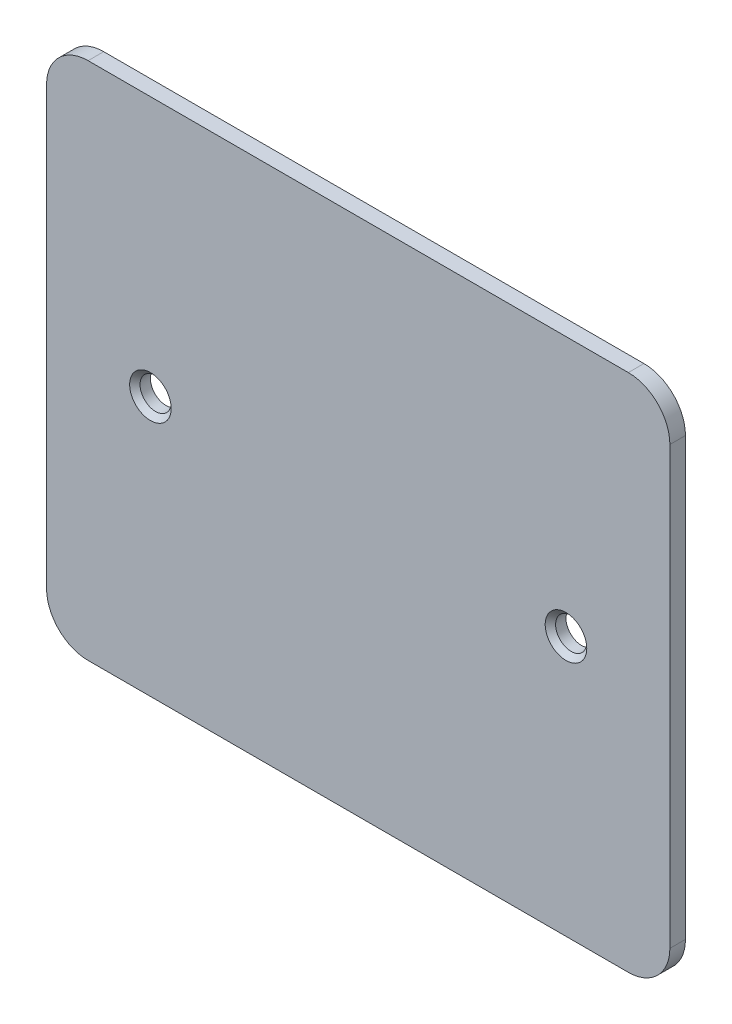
from build123d import *

# Parameters (mm, degrees)
ESQUISSE1_W      = 60
ESQUISSE1_H      = 50
ESQUISSE1_R      = 1.5
EXTRUSION1_DEPTH = 1.5
CHANFREIN1_SIZE  = 0.5
CONG_1_R         = 4


with BuildPart() as part:
    # Esquisse1 → Extrusion1 (new body)
    with BuildSketch(Plane.XY):
        with Locations((-30, 25)):
            Rectangle(ESQUISSE1_W, ESQUISSE1_H)
        with Locations((-50, 25)):
            Circle(ESQUISSE1_R, mode=Mode.SUBTRACT)
        with Locations((-10, 25)):
            Circle(ESQUISSE1_R, mode=Mode.SUBTRACT)
    extrude(amount=EXTRUSION1_DEPTH)

    # Chanfrein1
    chanfrein1_edges = [part.edges().sort_by_distance(p)[0] for p in [
        (-51.5, 25, 1.5),
        (-11.5, 25, 1.5),
    ]]
    chamfer(chanfrein1_edges, length=CHANFREIN1_SIZE)

    # Cong_1
    cong_1_edges = [part.edges().sort_by_distance(p)[0] for p in [
        (0, 0, 0.75),
        (-60, 0, 0.75),
        (-60, 50, 0.75),
        (0, 50, 0.75),
    ]]
    fillet(cong_1_edges, radius=CONG_1_R)


solid = part.part
